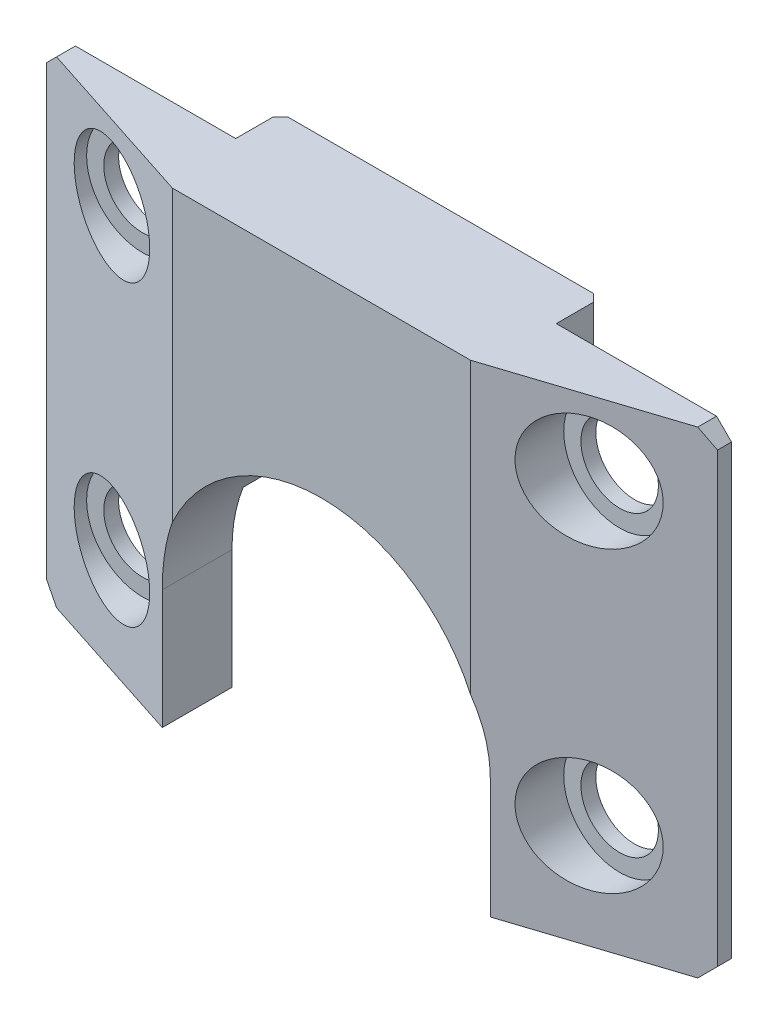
ISO-10303-21;
HEADER;
FILE_DESCRIPTION(('STEP AP214'),'2;1');
FILE_NAME('part.step','',(''),(''),'','','');
FILE_SCHEMA(('AUTOMOTIVE_DESIGN { 1 0 10303 214 1 1 1 1 }'));
ENDSEC;
DATA;
#1=APPLICATION_CONTEXT('core data for automotive mechanical design processes');
#2=APPLICATION_PROTOCOL_DEFINITION('international standard','automotive_design',2000,#1);
#3=PRODUCT_CONTEXT('',#1,'mechanical');
#4=PRODUCT('Part','Part','',(#3));
#5=PRODUCT_RELATED_PRODUCT_CATEGORY('part','',(#4));
#6=PRODUCT_DEFINITION_FORMATION('','',#4);
#7=PRODUCT_DEFINITION_CONTEXT('part definition',#1,'design');
#8=PRODUCT_DEFINITION('design','',#6,#7);
#9=PRODUCT_DEFINITION_SHAPE('','',#8);
#10=(LENGTH_UNIT() NAMED_UNIT(*) SI_UNIT(.MILLI.,.METRE.));
#11=(NAMED_UNIT(*) PLANE_ANGLE_UNIT() SI_UNIT($,.RADIAN.));
#12=(NAMED_UNIT(*) SI_UNIT($,.STERADIAN.) SOLID_ANGLE_UNIT());
#13=UNCERTAINTY_MEASURE_WITH_UNIT(LENGTH_MEASURE(1.E-05),#10,'distance_accuracy_value','');
#14=(GEOMETRIC_REPRESENTATION_CONTEXT(3) GLOBAL_UNCERTAINTY_ASSIGNED_CONTEXT((#13)) GLOBAL_UNIT_ASSIGNED_CONTEXT((#10,
#11,#12)) REPRESENTATION_CONTEXT('',''));
#15=CARTESIAN_POINT('',(0.,0.,0.));
#16=DIRECTION('',(0.,0.,1.));
#17=DIRECTION('',(1.,0.,0.));
#18=AXIS2_PLACEMENT_3D('',#15,#16,#17);
#19=CARTESIAN_POINT('',(0.,0.,-4.));
#20=DIRECTION('',(0.,0.,-1.));
#21=DIRECTION('',(-1.,0.,0.));
#22=AXIS2_PLACEMENT_3D('',#19,#20,#21);
#23=PLANE('',#22);
#24=CARTESIAN_POINT('',(-16.,-5.,-4.));
#25=DIRECTION('',(0.,0.,1.));
#26=DIRECTION('',(1.,0.,0.));
#27=AXIS2_PLACEMENT_3D('',#24,#25,#26);
#28=CIRCLE('',#27,2.6);
#29=CARTESIAN_POINT('',(-13.4,-5.,-4.));
#30=VERTEX_POINT('',#29);
#31=EDGE_CURVE('E175',#30,#30,#28,.F.);
#32=ORIENTED_EDGE('',*,*,#31,.T.);
#33=EDGE_LOOP('',(#32));
#34=FACE_BOUND('',#33,.T.);
#35=CARTESIAN_POINT('',(-16.,-5.,-4.));
#36=DIRECTION('',(0.,0.,-1.));
#37=DIRECTION('',(-1.,0.,0.));
#38=AXIS2_PLACEMENT_3D('',#35,#36,#37);
#39=CIRCLE('',#38,3.75);
#40=CARTESIAN_POINT('',(-19.75,-5.,-4.));
#41=VERTEX_POINT('',#40);
#42=EDGE_CURVE('E310',#41,#41,#39,.F.);
#43=ORIENTED_EDGE('',*,*,#42,.T.);
#44=EDGE_LOOP('',(#43));
#45=FACE_BOUND('',#44,.T.);
#46=ADVANCED_FACE('F16',(#34,#45),#23,.F.);
#47=CARTESIAN_POINT('',(0.,0.,-4.));
#48=DIRECTION('',(0.,0.,-1.));
#49=DIRECTION('',(-1.,0.,0.));
#50=AXIS2_PLACEMENT_3D('',#47,#48,#49);
#51=PLANE('',#50);
#52=CARTESIAN_POINT('',(-16.,-25.,-4.));
#53=DIRECTION('',(0.,0.,1.));
#54=DIRECTION('',(1.,0.,0.));
#55=AXIS2_PLACEMENT_3D('',#52,#53,#54);
#56=CIRCLE('',#55,2.6);
#57=CARTESIAN_POINT('',(-13.4,-25.,-4.));
#58=VERTEX_POINT('',#57);
#59=EDGE_CURVE('E213',#58,#58,#56,.F.);
#60=ORIENTED_EDGE('',*,*,#59,.T.);
#61=EDGE_LOOP('',(#60));
#62=FACE_BOUND('',#61,.T.);
#63=CARTESIAN_POINT('',(-16.,-25.,-4.));
#64=DIRECTION('',(0.,0.,-1.));
#65=DIRECTION('',(-1.,0.,0.));
#66=AXIS2_PLACEMENT_3D('',#63,#64,#65);
#67=CIRCLE('',#66,3.75);
#68=CARTESIAN_POINT('',(-19.75,-25.,-4.));
#69=VERTEX_POINT('',#68);
#70=EDGE_CURVE('E306',#69,#69,#67,.F.);
#71=ORIENTED_EDGE('',*,*,#70,.T.);
#72=EDGE_LOOP('',(#71));
#73=FACE_BOUND('',#72,.T.);
#74=ADVANCED_FACE('F333',(#62,#73),#51,.F.);
#75=CARTESIAN_POINT('',(-10.25,0.,-8.));
#76=DIRECTION('',(-0.707106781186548,0.,-0.707106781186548));
#77=DIRECTION('',(-0.707106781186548,0.,0.707106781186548));
#78=AXIS2_PLACEMENT_3D('',#75,#76,#77);
#79=PLANE('',#78);
#80=DIRECTION('',(-0.707106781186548,0.,0.707106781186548));
#81=VECTOR('',#80,1.);
#82=CARTESIAN_POINT('',(-10.25,0.,-8.));
#83=LINE('',#82,#81);
#84=CARTESIAN_POINT('',(-10.75,0.,-7.5));
#85=VERTEX_POINT('',#84);
#86=CARTESIAN_POINT('',(-10.25,0.,-8.));
#87=VERTEX_POINT('',#86);
#88=EDGE_CURVE('E163',#85,#87,#83,.F.);
#89=ORIENTED_EDGE('',*,*,#88,.T.);
#90=DIRECTION('',(0.,1.,0.));
#91=VECTOR('',#90,1.);
#92=CARTESIAN_POINT('',(-10.25,0.,-8.));
#93=LINE('',#92,#91);
#94=CARTESIAN_POINT('',(-10.2492760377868,-20.0027635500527,-8.00019195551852));
#95=VERTEX_POINT('',#94);
#96=EDGE_CURVE('E290',#95,#87,#93,.T.);
#97=ORIENTED_EDGE('',*,*,#96,.F.);
#98=DIRECTION('',(-0.707106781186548,0.,0.707106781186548));
#99=VECTOR('',#98,1.);
#100=CARTESIAN_POINT('',(8.375,-20.,-26.625));
#101=LINE('',#100,#99);
#102=CARTESIAN_POINT('',(-10.75,-20.,-7.5));
#103=VERTEX_POINT('',#102);
#104=EDGE_CURVE('E176',#95,#103,#101,.T.);
#105=ORIENTED_EDGE('',*,*,#104,.T.);
#106=DIRECTION('',(0.,1.,0.));
#107=VECTOR('',#106,1.);
#108=CARTESIAN_POINT('',(-10.75,0.,-7.5));
#109=LINE('',#108,#107);
#110=EDGE_CURVE('E180',#85,#103,#109,.F.);
#111=ORIENTED_EDGE('',*,*,#110,.F.);
#112=EDGE_LOOP('',(#89,#97,#105,#111));
#113=FACE_BOUND('',#112,.T.);
#114=ADVANCED_FACE('F181',(#113),#79,.T.);
#115=CARTESIAN_POINT('',(-16.,-5.,0.));
#116=DIRECTION('',(0.,0.,1.));
#117=DIRECTION('',(1.,0.,0.));
#118=AXIS2_PLACEMENT_3D('',#115,#116,#117);
#119=CYLINDRICAL_SURFACE('',#118,2.6);
#120=CARTESIAN_POINT('',(-16.,-5.,-5.));
#121=DIRECTION('',(0.,0.,1.));
#122=DIRECTION('',(1.,0.,0.));
#123=AXIS2_PLACEMENT_3D('',#120,#121,#122);
#124=CIRCLE('',#123,2.6);
#125=CARTESIAN_POINT('',(-13.4,-5.,-5.));
#126=VERTEX_POINT('',#125);
#127=EDGE_CURVE('E282',#126,#126,#124,.T.);
#128=ORIENTED_EDGE('',*,*,#127,.F.);
#129=EDGE_LOOP('',(#128));
#130=FACE_BOUND('',#129,.T.);
#131=ORIENTED_EDGE('',*,*,#31,.F.);
#132=EDGE_LOOP('',(#131));
#133=FACE_BOUND('',#132,.T.);
#134=ADVANCED_FACE('F320',(#130,#133),#119,.F.);
#135=CARTESIAN_POINT('',(-16.,-25.,0.));
#136=DIRECTION('',(0.,0.,1.));
#137=DIRECTION('',(1.,0.,0.));
#138=AXIS2_PLACEMENT_3D('',#135,#136,#137);
#139=CYLINDRICAL_SURFACE('',#138,2.6);
#140=CARTESIAN_POINT('',(-16.,-25.,-5.));
#141=DIRECTION('',(0.,0.,1.));
#142=DIRECTION('',(1.,0.,0.));
#143=AXIS2_PLACEMENT_3D('',#140,#141,#142);
#144=CIRCLE('',#143,2.6);
#145=CARTESIAN_POINT('',(-13.4,-25.,-5.));
#146=VERTEX_POINT('',#145);
#147=EDGE_CURVE('E278',#146,#146,#144,.T.);
#148=ORIENTED_EDGE('',*,*,#147,.F.);
#149=EDGE_LOOP('',(#148));
#150=FACE_BOUND('',#149,.T.);
#151=ORIENTED_EDGE('',*,*,#59,.F.);
#152=EDGE_LOOP('',(#151));
#153=FACE_BOUND('',#152,.T.);
#154=ADVANCED_FACE('F322',(#150,#153),#139,.F.);
#155=CARTESIAN_POINT('',(0.,-32.,0.));
#156=DIRECTION('',(0.,-1.,0.));
#157=DIRECTION('',(0.,0.,-1.));
#158=AXIS2_PLACEMENT_3D('',#155,#156,#157);
#159=PLANE('',#158);
#160=DIRECTION('',(0.,0.,1.));
#161=VECTOR('',#160,1.);
#162=CARTESIAN_POINT('',(-11.,-32.,0.));
#163=LINE('',#162,#161);
#164=CARTESIAN_POINT('',(-11.,-32.,-5.));
#165=VERTEX_POINT('',#164);
#166=CARTESIAN_POINT('',(-11.,-32.,-0.324919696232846));
#167=VERTEX_POINT('',#166);
#168=EDGE_CURVE('E458',#165,#167,#163,.T.);
#169=ORIENTED_EDGE('',*,*,#168,.T.);
#170=DIRECTION('',(-0.951056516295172,0.,-0.309016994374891));
#171=VECTOR('',#170,1.);
#172=CARTESIAN_POINT('',(-10.,-32.,0.));
#173=LINE('',#172,#171);
#174=CARTESIAN_POINT('',(-21.5,-32.,-3.73657650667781));
#175=VERTEX_POINT('',#174);
#176=EDGE_CURVE('E222',#167,#175,#173,.T.);
#177=ORIENTED_EDGE('',*,*,#176,.T.);
#178=DIRECTION('',(0.,0.,1.));
#179=VECTOR('',#178,1.);
#180=CARTESIAN_POINT('',(-21.5,-32.,0.));
#181=LINE('',#180,#179);
#182=CARTESIAN_POINT('',(-21.5,-32.,-5.));
#183=VERTEX_POINT('',#182);
#184=EDGE_CURVE('E210',#175,#183,#181,.F.);
#185=ORIENTED_EDGE('',*,*,#184,.T.);
#186=DIRECTION('',(-1.,0.,0.));
#187=VECTOR('',#186,1.);
#188=CARTESIAN_POINT('',(10.75,-32.,-5.));
#189=LINE('',#188,#187);
#190=EDGE_CURVE('E207',#165,#183,#189,.T.);
#191=ORIENTED_EDGE('',*,*,#190,.F.);
#192=EDGE_LOOP('',(#169,#177,#185,#191));
#193=FACE_BOUND('',#192,.T.);
#194=ADVANCED_FACE('F330',(#193),#159,.T.);
#195=CARTESIAN_POINT('',(-21.5,-32.,0.));
#196=DIRECTION('',(0.707106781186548,0.707106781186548,0.));
#197=DIRECTION('',(-0.707106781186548,0.707106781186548,0.));
#198=AXIS2_PLACEMENT_3D('',#195,#196,#197);
#199=PLANE('',#198);
#200=DIRECTION('',(-0.707106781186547,0.707106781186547,0.));
#201=VECTOR('',#200,1.);
#202=CARTESIAN_POINT('',(-21.5,-32.,-5.));
#203=LINE('',#202,#201);
#204=CARTESIAN_POINT('',(-22.5,-31.,-5.));
#205=VERTEX_POINT('',#204);
#206=EDGE_CURVE('E203',#183,#205,#203,.T.);
#207=ORIENTED_EDGE('',*,*,#206,.F.);
#208=ORIENTED_EDGE('',*,*,#184,.F.);
#209=DIRECTION('',(-0.689151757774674,0.689151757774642,-0.223918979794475));
#210=VECTOR('',#209,1.);
#211=CARTESIAN_POINT('',(-21.5000000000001,-32.,-3.7365765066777));
#212=LINE('',#211,#210);
#213=CARTESIAN_POINT('',(-22.5,-31.,-4.06149620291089));
#214=VERTEX_POINT('',#213);
#215=EDGE_CURVE('E220',#175,#214,#212,.T.);
#216=ORIENTED_EDGE('',*,*,#215,.T.);
#217=DIRECTION('',(0.,0.,1.));
#218=VECTOR('',#217,1.);
#219=CARTESIAN_POINT('',(-22.5,-31.,0.));
#220=LINE('',#219,#218);
#221=EDGE_CURVE('E212',#205,#214,#220,.T.);
#222=ORIENTED_EDGE('',*,*,#221,.F.);
#223=EDGE_LOOP('',(#207,#208,#216,#222));
#224=FACE_BOUND('',#223,.T.);
#225=ADVANCED_FACE('F449',(#224),#199,.F.);
#226=CARTESIAN_POINT('',(-22.5,0.,0.));
#227=DIRECTION('',(-1.,0.,0.));
#228=DIRECTION('',(0.,0.,1.));
#229=AXIS2_PLACEMENT_3D('',#226,#227,#228);
#230=PLANE('',#229);
#231=ORIENTED_EDGE('',*,*,#221,.T.);
#232=DIRECTION('',(0.,1.,0.));
#233=VECTOR('',#232,1.);
#234=CARTESIAN_POINT('',(-22.5000000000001,0.,-4.06149620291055));
#235=LINE('',#234,#233);
#236=CARTESIAN_POINT('',(-22.5,-1.,-4.06149620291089));
#237=VERTEX_POINT('',#236);
#238=EDGE_CURVE('E94',#214,#237,#235,.T.);
#239=ORIENTED_EDGE('',*,*,#238,.T.);
#240=DIRECTION('',(0.,0.,1.));
#241=VECTOR('',#240,1.);
#242=CARTESIAN_POINT('',(-22.5,-0.999999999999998,0.));
#243=LINE('',#242,#241);
#244=CARTESIAN_POINT('',(-22.5,-1.,-5.));
#245=VERTEX_POINT('',#244);
#246=EDGE_CURVE('E186',#245,#237,#243,.T.);
#247=ORIENTED_EDGE('',*,*,#246,.F.);
#248=DIRECTION('',(0.,1.,0.));
#249=VECTOR('',#248,1.);
#250=CARTESIAN_POINT('',(-22.5,0.,-5.));
#251=LINE('',#250,#249);
#252=EDGE_CURVE('E206',#205,#245,#251,.T.);
#253=ORIENTED_EDGE('',*,*,#252,.F.);
#254=EDGE_LOOP('',(#231,#239,#247,#253));
#255=FACE_BOUND('',#254,.T.);
#256=ADVANCED_FACE('F445',(#255),#230,.T.);
#257=CARTESIAN_POINT('',(-16.,-5.,-4.));
#258=DIRECTION('',(0.,0.,-1.));
#259=DIRECTION('',(-1.,0.,0.));
#260=AXIS2_PLACEMENT_3D('',#257,#258,#259);
#261=CYLINDRICAL_SURFACE('',#260,3.75);
#262=ORIENTED_EDGE('',*,*,#42,.F.);
#263=EDGE_LOOP('',(#262));
#264=FACE_BOUND('',#263,.T.);
#265=CARTESIAN_POINT('',(-16.,-5.,-1.94951817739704));
#266=DIRECTION('',(0.309016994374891,0.,-0.951056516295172));
#267=DIRECTION('',(-0.951056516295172,0.,-0.309016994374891));
#268=AXIS2_PLACEMENT_3D('',#265,#266,#267);
#269=ELLIPSE('',#268,3.94298334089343,3.75);
#270=CARTESIAN_POINT('',(-19.75,-5.,-3.1679670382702));
#271=VERTEX_POINT('',#270);
#272=EDGE_CURVE('E274',#271,#271,#269,.F.);
#273=ORIENTED_EDGE('',*,*,#272,.T.);
#274=EDGE_LOOP('',(#273));
#275=FACE_BOUND('',#274,.T.);
#276=ADVANCED_FACE('F441',(#264,#275),#261,.F.);
#277=CARTESIAN_POINT('',(-16.,-25.,-4.));
#278=DIRECTION('',(0.,0.,-1.));
#279=DIRECTION('',(-1.,0.,0.));
#280=AXIS2_PLACEMENT_3D('',#277,#278,#279);
#281=CYLINDRICAL_SURFACE('',#280,3.75);
#282=ORIENTED_EDGE('',*,*,#70,.F.);
#283=EDGE_LOOP('',(#282));
#284=FACE_BOUND('',#283,.T.);
#285=CARTESIAN_POINT('',(-16.,-25.,-1.94951817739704));
#286=DIRECTION('',(0.309016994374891,0.,-0.951056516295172));
#287=DIRECTION('',(-0.951056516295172,0.,-0.309016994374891));
#288=AXIS2_PLACEMENT_3D('',#285,#286,#287);
#289=ELLIPSE('',#288,3.94298334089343,3.75);
#290=CARTESIAN_POINT('',(-19.75,-25.,-3.1679670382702));
#291=VERTEX_POINT('',#290);
#292=EDGE_CURVE('E270',#291,#291,#289,.F.);
#293=ORIENTED_EDGE('',*,*,#292,.T.);
#294=EDGE_LOOP('',(#293));
#295=FACE_BOUND('',#294,.T.);
#296=ADVANCED_FACE('F437',(#284,#295),#281,.F.);
#297=CARTESIAN_POINT('',(16.,-5.,-4.));
#298=DIRECTION('',(0.,0.,-1.));
#299=DIRECTION('',(-1.,0.,0.));
#300=AXIS2_PLACEMENT_3D('',#297,#298,#299);
#301=CYLINDRICAL_SURFACE('',#300,3.75);
#302=CARTESIAN_POINT('',(16.,-5.,-4.));
#303=DIRECTION('',(0.,0.,-1.));
#304=DIRECTION('',(-1.,0.,0.));
#305=AXIS2_PLACEMENT_3D('',#302,#303,#304);
#306=CIRCLE('',#305,3.75);
#307=CARTESIAN_POINT('',(12.25,-5.,-4.));
#308=VERTEX_POINT('',#307);
#309=EDGE_CURVE('E266',#308,#308,#306,.T.);
#310=ORIENTED_EDGE('',*,*,#309,.T.);
#311=EDGE_LOOP('',(#310));
#312=FACE_BOUND('',#311,.T.);
#313=CARTESIAN_POINT('',(16.,-5.,-1.94951817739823));
#314=DIRECTION('',(-0.309016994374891,0.,-0.951056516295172));
#315=DIRECTION('',(0.951056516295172,0.,-0.309016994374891));
#316=AXIS2_PLACEMENT_3D('',#313,#314,#315);
#317=ELLIPSE('',#316,3.94298334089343,3.75);
#318=CARTESIAN_POINT('',(19.75,-5.,-3.16796703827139));
#319=VERTEX_POINT('',#318);
#320=EDGE_CURVE('E301',#319,#319,#317,.F.);
#321=ORIENTED_EDGE('',*,*,#320,.T.);
#322=EDGE_LOOP('',(#321));
#323=FACE_BOUND('',#322,.T.);
#324=ADVANCED_FACE('F433',(#312,#323),#301,.F.);
#325=CARTESIAN_POINT('',(16.,-25.,-4.));
#326=DIRECTION('',(0.,0.,-1.));
#327=DIRECTION('',(-1.,0.,0.));
#328=AXIS2_PLACEMENT_3D('',#325,#326,#327);
#329=CYLINDRICAL_SURFACE('',#328,3.75);
#330=CARTESIAN_POINT('',(16.,-25.,-4.));
#331=DIRECTION('',(0.,0.,-1.));
#332=DIRECTION('',(-1.,0.,0.));
#333=AXIS2_PLACEMENT_3D('',#330,#331,#332);
#334=CIRCLE('',#333,3.75);
#335=CARTESIAN_POINT('',(12.25,-25.,-4.));
#336=VERTEX_POINT('',#335);
#337=EDGE_CURVE('E263',#336,#336,#334,.T.);
#338=ORIENTED_EDGE('',*,*,#337,.T.);
#339=EDGE_LOOP('',(#338));
#340=FACE_BOUND('',#339,.T.);
#341=CARTESIAN_POINT('',(16.,-25.,-1.94951817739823));
#342=DIRECTION('',(-0.309016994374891,0.,-0.951056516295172));
#343=DIRECTION('',(0.951056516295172,0.,-0.309016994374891));
#344=AXIS2_PLACEMENT_3D('',#341,#342,#343);
#345=ELLIPSE('',#344,3.94298334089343,3.75);
#346=CARTESIAN_POINT('',(19.75,-25.,-3.16796703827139));
#347=VERTEX_POINT('',#346);
#348=EDGE_CURVE('E185',#347,#347,#345,.F.);
#349=ORIENTED_EDGE('',*,*,#348,.T.);
#350=EDGE_LOOP('',(#349));
#351=FACE_BOUND('',#350,.T.);
#352=ADVANCED_FACE('F430',(#340,#351),#329,.F.);
#353=CARTESIAN_POINT('',(10.75,0.,-7.5));
#354=DIRECTION('',(0.707106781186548,0.,-0.707106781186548));
#355=DIRECTION('',(-0.707106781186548,0.,-0.707106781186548));
#356=AXIS2_PLACEMENT_3D('',#353,#354,#355);
#357=PLANE('',#356);
#358=DIRECTION('',(-0.707106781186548,0.,-0.707106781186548));
#359=VECTOR('',#358,1.);
#360=CARTESIAN_POINT('',(10.75,0.,-7.5));
#361=LINE('',#360,#359);
#362=CARTESIAN_POINT('',(10.25,0.,-8.));
#363=VERTEX_POINT('',#362);
#364=CARTESIAN_POINT('',(10.75,0.,-7.5));
#365=VERTEX_POINT('',#364);
#366=EDGE_CURVE('E309',#363,#365,#361,.F.);
#367=ORIENTED_EDGE('',*,*,#366,.T.);
#368=DIRECTION('',(0.,1.,0.));
#369=VECTOR('',#368,1.);
#370=CARTESIAN_POINT('',(10.75,0.,-7.5));
#371=LINE('',#370,#369);
#372=CARTESIAN_POINT('',(10.75,-20.,-7.5));
#373=VERTEX_POINT('',#372);
#374=EDGE_CURVE('E82',#373,#365,#371,.T.);
#375=ORIENTED_EDGE('',*,*,#374,.F.);
#376=DIRECTION('',(-0.707106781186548,0.,-0.707106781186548));
#377=VECTOR('',#376,1.);
#378=CARTESIAN_POINT('',(10.75,-20.,-7.5));
#379=LINE('',#378,#377);
#380=CARTESIAN_POINT('',(10.2492074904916,-20.0027399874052,-8.00012340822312));
#381=VERTEX_POINT('',#380);
#382=EDGE_CURVE('E294',#373,#381,#379,.T.);
#383=ORIENTED_EDGE('',*,*,#382,.T.);
#384=DIRECTION('',(0.,-1.,0.));
#385=VECTOR('',#384,1.);
#386=CARTESIAN_POINT('',(10.25,0.,-8.));
#387=LINE('',#386,#385);
#388=EDGE_CURVE('E286',#363,#381,#387,.T.);
#389=ORIENTED_EDGE('',*,*,#388,.F.);
#390=EDGE_LOOP('',(#367,#375,#383,#389));
#391=FACE_BOUND('',#390,.T.);
#392=ADVANCED_FACE('F426',(#391),#357,.T.);
#393=CARTESIAN_POINT('',(-21.5,0.,0.));
#394=DIRECTION('',(-0.707106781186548,0.707106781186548,0.));
#395=DIRECTION('',(-0.707106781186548,-0.707106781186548,0.));
#396=AXIS2_PLACEMENT_3D('',#393,#394,#395);
#397=PLANE('',#396);
#398=ORIENTED_EDGE('',*,*,#246,.T.);
#399=DIRECTION('',(0.689151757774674,0.689151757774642,0.223918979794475));
#400=VECTOR('',#399,1.);
#401=CARTESIAN_POINT('',(-22.5000000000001,-1.,-4.06149620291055));
#402=LINE('',#401,#400);
#403=CARTESIAN_POINT('',(-21.5,0.,-3.73657650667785));
#404=VERTEX_POINT('',#403);
#405=EDGE_CURVE('E277',#237,#404,#402,.T.);
#406=ORIENTED_EDGE('',*,*,#405,.T.);
#407=DIRECTION('',(0.,0.,-1.));
#408=VECTOR('',#407,1.);
#409=CARTESIAN_POINT('',(-21.5,0.,0.));
#410=LINE('',#409,#408);
#411=CARTESIAN_POINT('',(-21.5,0.,-5.));
#412=VERTEX_POINT('',#411);
#413=EDGE_CURVE('E196',#404,#412,#410,.T.);
#414=ORIENTED_EDGE('',*,*,#413,.T.);
#415=DIRECTION('',(0.707106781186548,0.707106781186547,0.));
#416=VECTOR('',#415,1.);
#417=CARTESIAN_POINT('',(-22.5,-1.,-5.));
#418=LINE('',#417,#416);
#419=EDGE_CURVE('E487',#245,#412,#418,.T.);
#420=ORIENTED_EDGE('',*,*,#419,.F.);
#421=EDGE_LOOP('',(#398,#406,#414,#420));
#422=FACE_BOUND('',#421,.T.);
#423=ADVANCED_FACE('F423',(#422),#397,.T.);
#424=CARTESIAN_POINT('',(-10.75,0.,-5.));
#425=DIRECTION('',(-1.,0.,0.));
#426=DIRECTION('',(0.,0.,1.));
#427=AXIS2_PLACEMENT_3D('',#424,#425,#426);
#428=PLANE('',#427);
#429=ORIENTED_EDGE('',*,*,#110,.T.);
#430=DIRECTION('',(0.,0.,1.));
#431=VECTOR('',#430,1.);
#432=CARTESIAN_POINT('',(-10.75,-20.,-8.));
#433=LINE('',#432,#431);
#434=CARTESIAN_POINT('',(-10.75,-20.,-5.));
#435=VERTEX_POINT('',#434);
#436=EDGE_CURVE('E289',#103,#435,#433,.T.);
#437=ORIENTED_EDGE('',*,*,#436,.T.);
#438=DIRECTION('',(0.,1.,0.));
#439=VECTOR('',#438,1.);
#440=CARTESIAN_POINT('',(-10.75,0.,-5.));
#441=LINE('',#440,#439);
#442=CARTESIAN_POINT('',(-10.75,0.,-5.));
#443=VERTEX_POINT('',#442);
#444=EDGE_CURVE('E190',#443,#435,#441,.F.);
#445=ORIENTED_EDGE('',*,*,#444,.F.);
#446=DIRECTION('',(0.,0.,-1.));
#447=VECTOR('',#446,1.);
#448=CARTESIAN_POINT('',(-10.75,0.,0.));
#449=LINE('',#448,#447);
#450=EDGE_CURVE('E169',#443,#85,#449,.T.);
#451=ORIENTED_EDGE('',*,*,#450,.T.);
#452=EDGE_LOOP('',(#429,#437,#445,#451));
#453=FACE_BOUND('',#452,.T.);
#454=ADVANCED_FACE('F188',(#453),#428,.T.);
#455=CARTESIAN_POINT('',(30.,0.,-6.498393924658));
#456=DIRECTION('',(-0.309016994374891,0.,-0.951056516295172));
#457=DIRECTION('',(-0.951056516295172,0.,0.309016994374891));
#458=AXIS2_PLACEMENT_3D('',#455,#456,#457);
#459=PLANE('',#458);
#460=ORIENTED_EDGE('',*,*,#320,.F.);
#461=EDGE_LOOP('',(#460));
#462=FACE_BOUND('',#461,.T.);
#463=ORIENTED_EDGE('',*,*,#348,.F.);
#464=EDGE_LOOP('',(#463));
#465=FACE_BOUND('',#464,.T.);
#466=DIRECTION('',(0.,1.,0.));
#467=VECTOR('',#466,1.);
#468=CARTESIAN_POINT('',(10.,0.,0.));
#469=LINE('',#468,#467);
#470=CARTESIAN_POINT('',(9.99999999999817,-19.4174243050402,0.));
#471=VERTEX_POINT('',#470);
#472=CARTESIAN_POINT('',(9.99999999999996,0.,0.));
#473=VERTEX_POINT('',#472);
#474=EDGE_CURVE('E269',#471,#473,#469,.T.);
#475=ORIENTED_EDGE('',*,*,#474,.F.);
#476=CARTESIAN_POINT('',(0.,-24.,3.24919696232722));
#477=DIRECTION('',(-0.309016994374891,0.,-0.951056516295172));
#478=DIRECTION('',(-0.951056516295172,0.,0.309016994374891));
#479=AXIS2_PLACEMENT_3D('',#476,#477,#478);
#480=ELLIPSE('',#479,11.5660844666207,11.);
#481=CARTESIAN_POINT('',(11.,-24.,-0.324919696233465));
#482=VERTEX_POINT('',#481);
#483=EDGE_CURVE('E260',#471,#482,#480,.T.);
#484=ORIENTED_EDGE('',*,*,#483,.T.);
#485=DIRECTION('',(0.,1.,0.));
#486=VECTOR('',#485,1.);
#487=CARTESIAN_POINT('',(11.,-32.,-0.3249196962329));
#488=LINE('',#487,#486);
#489=CARTESIAN_POINT('',(11.,-32.,-0.3249196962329));
#490=VERTEX_POINT('',#489);
#491=EDGE_CURVE('E503',#482,#490,#488,.F.);
#492=ORIENTED_EDGE('',*,*,#491,.T.);
#493=DIRECTION('',(-0.951056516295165,0.,0.309016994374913));
#494=VECTOR('',#493,1.);
#495=CARTESIAN_POINT('',(21.5,-32.,-3.736576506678));
#496=LINE('',#495,#494);
#497=CARTESIAN_POINT('',(21.5,-32.,-3.736576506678));
#498=VERTEX_POINT('',#497);
#499=EDGE_CURVE('E505',#498,#490,#496,.T.);
#500=ORIENTED_EDGE('',*,*,#499,.F.);
#501=DIRECTION('',(0.689151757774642,0.689151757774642,-0.223918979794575));
#502=VECTOR('',#501,1.);
#503=CARTESIAN_POINT('',(21.5,-32.,-3.736576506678));
#504=LINE('',#503,#502);
#505=CARTESIAN_POINT('',(22.5,-31.,-4.061496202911));
#506=VERTEX_POINT('',#505);
#507=EDGE_CURVE('E513',#498,#506,#504,.T.);
#508=ORIENTED_EDGE('',*,*,#507,.T.);
#509=DIRECTION('',(0.,1.,0.));
#510=VECTOR('',#509,1.);
#511=CARTESIAN_POINT('',(22.5,0.,-4.061496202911));
#512=LINE('',#511,#510);
#513=CARTESIAN_POINT('',(22.5,-0.999999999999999,-4.061496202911));
#514=VERTEX_POINT('',#513);
#515=EDGE_CURVE('E516',#514,#506,#512,.F.);
#516=ORIENTED_EDGE('',*,*,#515,.F.);
#517=DIRECTION('',(0.689151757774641,-0.689151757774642,-0.223918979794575));
#518=VECTOR('',#517,1.);
#519=CARTESIAN_POINT('',(21.5,0.,-3.736576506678));
#520=LINE('',#519,#518);
#521=CARTESIAN_POINT('',(21.5,0.,-3.736576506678));
#522=VERTEX_POINT('',#521);
#523=EDGE_CURVE('E524',#522,#514,#520,.T.);
#524=ORIENTED_EDGE('',*,*,#523,.F.);
#525=DIRECTION('',(-0.951056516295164,0.,0.309016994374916));
#526=VECTOR('',#525,1.);
#527=CARTESIAN_POINT('',(21.5,0.,-3.736576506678));
#528=LINE('',#527,#526);
#529=EDGE_CURVE('E529',#522,#473,#528,.T.);
#530=ORIENTED_EDGE('',*,*,#529,.T.);
#531=EDGE_LOOP('',(#475,#484,#492,#500,#508,#516,#524,#530));
#532=FACE_BOUND('',#531,.T.);
#533=ADVANCED_FACE('F416',(#462,#465,#532),#459,.F.);
#534=CARTESIAN_POINT('',(27.,-20.,-8.));
#535=DIRECTION('',(0.,1.,0.));
#536=DIRECTION('',(0.,0.,1.));
#537=AXIS2_PLACEMENT_3D('',#534,#535,#536);
#538=PLANE('',#537);
#539=DIRECTION('',(0.,0.,-1.));
#540=VECTOR('',#539,1.);
#541=CARTESIAN_POINT('',(10.75,-20.,-8.));
#542=LINE('',#541,#540);
#543=CARTESIAN_POINT('',(10.75,-20.,-5.));
#544=VERTEX_POINT('',#543);
#545=EDGE_CURVE('E532',#544,#373,#542,.T.);
#546=ORIENTED_EDGE('',*,*,#545,.F.);
#547=DIRECTION('',(1.,0.,0.));
#548=VECTOR('',#547,1.);
#549=CARTESIAN_POINT('',(27.,-20.,-5.));
#550=LINE('',#549,#548);
#551=CARTESIAN_POINT('',(10.2469507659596,-20.,-5.));
#552=VERTEX_POINT('',#551);
#553=EDGE_CURVE('E298',#552,#544,#550,.T.);
#554=ORIENTED_EDGE('',*,*,#553,.F.);
#555=DIRECTION('',(0.,0.,1.));
#556=VECTOR('',#555,1.);
#557=CARTESIAN_POINT('',(10.2469507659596,-20.,-5.));
#558=LINE('',#557,#556);
#559=EDGE_CURVE('E253',#552,#381,#558,.F.);
#560=ORIENTED_EDGE('',*,*,#559,.T.);
#561=ORIENTED_EDGE('',*,*,#382,.F.);
#562=EDGE_LOOP('',(#546,#554,#560,#561));
#563=FACE_BOUND('',#562,.T.);
#564=ADVANCED_FACE('F412',(#563),#538,.F.);
#565=CARTESIAN_POINT('',(-10.75,0.,-8.));
#566=DIRECTION('',(0.,0.,-1.));
#567=DIRECTION('',(-1.,0.,0.));
#568=AXIS2_PLACEMENT_3D('',#565,#566,#567);
#569=PLANE('',#568);
#570=ORIENTED_EDGE('',*,*,#388,.T.);
#571=CARTESIAN_POINT('',(0.,-24.,-8.));
#572=DIRECTION('',(0.,0.,1.));
#573=DIRECTION('',(1.,0.,0.));
#574=AXIS2_PLACEMENT_3D('',#571,#572,#573);
#575=CIRCLE('',#574,11.);
#576=EDGE_CURVE('E248',#381,#95,#575,.T.);
#577=ORIENTED_EDGE('',*,*,#576,.T.);
#578=ORIENTED_EDGE('',*,*,#96,.T.);
#579=DIRECTION('',(1.,0.,0.));
#580=VECTOR('',#579,1.);
#581=CARTESIAN_POINT('',(0.,0.,-8.));
#582=LINE('',#581,#580);
#583=EDGE_CURVE('E171',#87,#363,#582,.T.);
#584=ORIENTED_EDGE('',*,*,#583,.T.);
#585=EDGE_LOOP('',(#570,#577,#578,#584));
#586=FACE_BOUND('',#585,.T.);
#587=ADVANCED_FACE('F408',(#586),#569,.T.);
#588=CARTESIAN_POINT('',(27.,-20.,-8.));
#589=DIRECTION('',(0.,1.,0.));
#590=DIRECTION('',(0.,0.,1.));
#591=AXIS2_PLACEMENT_3D('',#588,#589,#590);
#592=PLANE('',#591);
#593=ORIENTED_EDGE('',*,*,#436,.F.);
#594=ORIENTED_EDGE('',*,*,#104,.F.);
#595=DIRECTION('',(0.,0.,1.));
#596=VECTOR('',#595,1.);
#597=CARTESIAN_POINT('',(-10.2469507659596,-20.,-8.00019195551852));
#598=LINE('',#597,#596);
#599=CARTESIAN_POINT('',(-10.2469507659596,-20.,-5.));
#600=VERTEX_POINT('',#599);
#601=EDGE_CURVE('E246',#95,#600,#598,.T.);
#602=ORIENTED_EDGE('',*,*,#601,.T.);
#603=DIRECTION('',(-1.,0.,0.));
#604=VECTOR('',#603,1.);
#605=CARTESIAN_POINT('',(10.75,-20.,-5.));
#606=LINE('',#605,#604);
#607=EDGE_CURVE('E285',#435,#600,#606,.F.);
#608=ORIENTED_EDGE('',*,*,#607,.F.);
#609=EDGE_LOOP('',(#593,#594,#602,#608));
#610=FACE_BOUND('',#609,.T.);
#611=ADVANCED_FACE('F404',(#610),#592,.F.);
#612=CARTESIAN_POINT('',(10.75,0.,-5.));
#613=DIRECTION('',(0.,0.,-1.));
#614=DIRECTION('',(-1.,0.,0.));
#615=AXIS2_PLACEMENT_3D('',#612,#613,#614);
#616=PLANE('',#615);
#617=ORIENTED_EDGE('',*,*,#147,.T.);
#618=EDGE_LOOP('',(#617));
#619=FACE_BOUND('',#618,.T.);
#620=ORIENTED_EDGE('',*,*,#127,.T.);
#621=EDGE_LOOP('',(#620));
#622=FACE_BOUND('',#621,.T.);
#623=ORIENTED_EDGE('',*,*,#607,.T.);
#624=CARTESIAN_POINT('',(0.,-24.,-5.));
#625=DIRECTION('',(0.,0.,1.));
#626=DIRECTION('',(1.,0.,0.));
#627=AXIS2_PLACEMENT_3D('',#624,#625,#626);
#628=CIRCLE('',#627,11.);
#629=CARTESIAN_POINT('',(-11.,-24.,-5.));
#630=VERTEX_POINT('',#629);
#631=EDGE_CURVE('E244',#600,#630,#628,.T.);
#632=ORIENTED_EDGE('',*,*,#631,.T.);
#633=DIRECTION('',(0.,1.,0.));
#634=VECTOR('',#633,1.);
#635=CARTESIAN_POINT('',(-11.,-24.,-5.));
#636=LINE('',#635,#634);
#637=EDGE_CURVE('E281',#630,#165,#636,.F.);
#638=ORIENTED_EDGE('',*,*,#637,.T.);
#639=ORIENTED_EDGE('',*,*,#190,.T.);
#640=ORIENTED_EDGE('',*,*,#206,.T.);
#641=ORIENTED_EDGE('',*,*,#252,.T.);
#642=ORIENTED_EDGE('',*,*,#419,.T.);
#643=DIRECTION('',(1.,0.,0.));
#644=VECTOR('',#643,1.);
#645=CARTESIAN_POINT('',(0.,0.,-5.));
#646=LINE('',#645,#644);
#647=EDGE_CURVE('E192',#412,#443,#646,.T.);
#648=ORIENTED_EDGE('',*,*,#647,.T.);
#649=ORIENTED_EDGE('',*,*,#444,.T.);
#650=EDGE_LOOP('',(#623,#632,#638,#639,#640,#641,#642,#648,#649));
#651=FACE_BOUND('',#650,.T.);
#652=ADVANCED_FACE('F400',(#619,#622,#651),#616,.T.);
#653=CARTESIAN_POINT('',(-11.,-24.,0.));
#654=DIRECTION('',(-1.,0.,0.));
#655=DIRECTION('',(0.,0.,1.));
#656=AXIS2_PLACEMENT_3D('',#653,#654,#655);
#657=PLANE('',#656);
#658=ORIENTED_EDGE('',*,*,#637,.F.);
#659=DIRECTION('',(0.,0.,1.));
#660=VECTOR('',#659,1.);
#661=CARTESIAN_POINT('',(-11.,-24.,0.));
#662=LINE('',#661,#660);
#663=CARTESIAN_POINT('',(-11.,-24.,-0.324919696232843));
#664=VERTEX_POINT('',#663);
#665=EDGE_CURVE('E243',#630,#664,#662,.T.);
#666=ORIENTED_EDGE('',*,*,#665,.T.);
#667=DIRECTION('',(0.,1.,0.));
#668=VECTOR('',#667,1.);
#669=CARTESIAN_POINT('',(-11.,0.,-0.324919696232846));
#670=LINE('',#669,#668);
#671=EDGE_CURVE('E465',#664,#167,#670,.F.);
#672=ORIENTED_EDGE('',*,*,#671,.T.);
#673=ORIENTED_EDGE('',*,*,#168,.F.);
#674=EDGE_LOOP('',(#658,#666,#672,#673));
#675=FACE_BOUND('',#674,.T.);
#676=ADVANCED_FACE('F396',(#675),#657,.F.);
#677=CARTESIAN_POINT('',(-10.,0.,0.));
#678=DIRECTION('',(0.309016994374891,0.,-0.951056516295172));
#679=DIRECTION('',(-0.951056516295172,0.,-0.309016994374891));
#680=AXIS2_PLACEMENT_3D('',#677,#678,#679);
#681=PLANE('',#680);
#682=ORIENTED_EDGE('',*,*,#292,.F.);
#683=EDGE_LOOP('',(#682));
#684=FACE_BOUND('',#683,.T.);
#685=ORIENTED_EDGE('',*,*,#272,.F.);
#686=EDGE_LOOP('',(#685));
#687=FACE_BOUND('',#686,.T.);
#688=DIRECTION('',(-0.951056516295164,0.,-0.309016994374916));
#689=VECTOR('',#688,1.);
#690=CARTESIAN_POINT('',(-10.,0.,0.));
#691=LINE('',#690,#689);
#692=CARTESIAN_POINT('',(-10.,0.,0.));
#693=VERTEX_POINT('',#692);
#694=EDGE_CURVE('E541',#693,#404,#691,.T.);
#695=ORIENTED_EDGE('',*,*,#694,.T.);
#696=ORIENTED_EDGE('',*,*,#405,.F.);
#697=ORIENTED_EDGE('',*,*,#238,.F.);
#698=ORIENTED_EDGE('',*,*,#215,.F.);
#699=ORIENTED_EDGE('',*,*,#176,.F.);
#700=ORIENTED_EDGE('',*,*,#671,.F.);
#701=CARTESIAN_POINT('',(0.,-24.,3.24919696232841));
#702=DIRECTION('',(0.309016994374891,0.,-0.951056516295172));
#703=DIRECTION('',(0.951056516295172,0.,0.309016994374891));
#704=AXIS2_PLACEMENT_3D('',#701,#702,#703);
#705=ELLIPSE('',#704,11.5660844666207,11.);
#706=CARTESIAN_POINT('',(-10.,-19.4174243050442,0.));
#707=VERTEX_POINT('',#706);
#708=EDGE_CURVE('E241',#664,#707,#705,.T.);
#709=ORIENTED_EDGE('',*,*,#708,.T.);
#710=DIRECTION('',(0.,1.,0.));
#711=VECTOR('',#710,1.);
#712=CARTESIAN_POINT('',(-10.,0.,0.));
#713=LINE('',#712,#711);
#714=EDGE_CURVE('E273',#693,#707,#713,.F.);
#715=ORIENTED_EDGE('',*,*,#714,.F.);
#716=EDGE_LOOP('',(#695,#696,#697,#698,#699,#700,#709,#715));
#717=FACE_BOUND('',#716,.T.);
#718=ADVANCED_FACE('F392',(#684,#687,#717),#681,.F.);
#719=CARTESIAN_POINT('',(22.5,0.,0.));
#720=DIRECTION('',(0.,0.,1.));
#721=DIRECTION('',(1.,0.,0.));
#722=AXIS2_PLACEMENT_3D('',#719,#720,#721);
#723=PLANE('',#722);
#724=CARTESIAN_POINT('',(0.,-24.,0.));
#725=DIRECTION('',(0.,0.,1.));
#726=DIRECTION('',(1.,0.,0.));
#727=AXIS2_PLACEMENT_3D('',#724,#725,#726);
#728=CIRCLE('',#727,11.);
#729=EDGE_CURVE('E238',#707,#471,#728,.F.);
#730=ORIENTED_EDGE('',*,*,#729,.T.);
#731=ORIENTED_EDGE('',*,*,#474,.T.);
#732=DIRECTION('',(1.,0.,0.));
#733=VECTOR('',#732,1.);
#734=CARTESIAN_POINT('',(0.,0.,0.));
#735=LINE('',#734,#733);
#736=EDGE_CURVE('E531',#473,#693,#735,.F.);
#737=ORIENTED_EDGE('',*,*,#736,.T.);
#738=ORIENTED_EDGE('',*,*,#714,.T.);
#739=EDGE_LOOP('',(#730,#731,#737,#738));
#740=FACE_BOUND('',#739,.T.);
#741=ADVANCED_FACE('F388',(#740),#723,.T.);
#742=CARTESIAN_POINT('',(0.,0.,-4.));
#743=DIRECTION('',(0.,0.,-1.));
#744=DIRECTION('',(-1.,0.,0.));
#745=AXIS2_PLACEMENT_3D('',#742,#743,#744);
#746=PLANE('',#745);
#747=CARTESIAN_POINT('',(16.,-5.,-4.));
#748=DIRECTION('',(0.,0.,1.));
#749=DIRECTION('',(1.,0.,0.));
#750=AXIS2_PLACEMENT_3D('',#747,#748,#749);
#751=CIRCLE('',#750,2.6);
#752=CARTESIAN_POINT('',(18.6,-5.,-4.));
#753=VERTEX_POINT('',#752);
#754=EDGE_CURVE('E235',#753,#753,#751,.F.);
#755=ORIENTED_EDGE('',*,*,#754,.T.);
#756=EDGE_LOOP('',(#755));
#757=FACE_BOUND('',#756,.T.);
#758=ORIENTED_EDGE('',*,*,#309,.F.);
#759=EDGE_LOOP('',(#758));
#760=FACE_BOUND('',#759,.T.);
#761=ADVANCED_FACE('F384',(#757,#760),#746,.F.);
#762=CARTESIAN_POINT('',(0.,0.,-4.));
#763=DIRECTION('',(0.,0.,-1.));
#764=DIRECTION('',(-1.,0.,0.));
#765=AXIS2_PLACEMENT_3D('',#762,#763,#764);
#766=PLANE('',#765);
#767=CARTESIAN_POINT('',(16.,-25.,-4.));
#768=DIRECTION('',(0.,0.,1.));
#769=DIRECTION('',(1.,0.,0.));
#770=AXIS2_PLACEMENT_3D('',#767,#768,#769);
#771=CIRCLE('',#770,2.6);
#772=CARTESIAN_POINT('',(18.6,-25.,-4.));
#773=VERTEX_POINT('',#772);
#774=EDGE_CURVE('E231',#773,#773,#771,.F.);
#775=ORIENTED_EDGE('',*,*,#774,.T.);
#776=EDGE_LOOP('',(#775));
#777=FACE_BOUND('',#776,.T.);
#778=ORIENTED_EDGE('',*,*,#337,.F.);
#779=EDGE_LOOP('',(#778));
#780=FACE_BOUND('',#779,.T.);
#781=ADVANCED_FACE('F380',(#777,#780),#766,.F.);
#782=CARTESIAN_POINT('',(10.75,0.,-8.));
#783=DIRECTION('',(1.,0.,0.));
#784=DIRECTION('',(0.,0.,-1.));
#785=AXIS2_PLACEMENT_3D('',#782,#783,#784);
#786=PLANE('',#785);
#787=DIRECTION('',(0.,1.,0.));
#788=VECTOR('',#787,1.);
#789=CARTESIAN_POINT('',(10.75,0.,-5.));
#790=LINE('',#789,#788);
#791=CARTESIAN_POINT('',(10.75,0.,-5.));
#792=VERTEX_POINT('',#791);
#793=EDGE_CURVE('E234',#544,#792,#790,.T.);
#794=ORIENTED_EDGE('',*,*,#793,.F.);
#795=ORIENTED_EDGE('',*,*,#545,.T.);
#796=ORIENTED_EDGE('',*,*,#374,.T.);
#797=DIRECTION('',(0.,0.,-1.));
#798=VECTOR('',#797,1.);
#799=CARTESIAN_POINT('',(10.75,0.,0.));
#800=LINE('',#799,#798);
#801=EDGE_CURVE('E194',#365,#792,#800,.F.);
#802=ORIENTED_EDGE('',*,*,#801,.T.);
#803=EDGE_LOOP('',(#794,#795,#796,#802));
#804=FACE_BOUND('',#803,.T.);
#805=ADVANCED_FACE('F377',(#804),#786,.T.);
#806=CARTESIAN_POINT('',(0.,0.,0.));
#807=DIRECTION('',(0.,-1.,0.));
#808=DIRECTION('',(0.,0.,-1.));
#809=AXIS2_PLACEMENT_3D('',#806,#807,#808);
#810=PLANE('',#809);
#811=DIRECTION('',(-1.,0.,0.));
#812=VECTOR('',#811,1.);
#813=CARTESIAN_POINT('',(10.75,0.,-5.));
#814=LINE('',#813,#812);
#815=CARTESIAN_POINT('',(21.5,0.,-5.));
#816=VERTEX_POINT('',#815);
#817=EDGE_CURVE('E603',#792,#816,#814,.F.);
#818=ORIENTED_EDGE('',*,*,#817,.F.);
#819=ORIENTED_EDGE('',*,*,#801,.F.);
#820=ORIENTED_EDGE('',*,*,#366,.F.);
#821=ORIENTED_EDGE('',*,*,#583,.F.);
#822=ORIENTED_EDGE('',*,*,#88,.F.);
#823=ORIENTED_EDGE('',*,*,#450,.F.);
#824=ORIENTED_EDGE('',*,*,#647,.F.);
#825=ORIENTED_EDGE('',*,*,#413,.F.);
#826=ORIENTED_EDGE('',*,*,#694,.F.);
#827=ORIENTED_EDGE('',*,*,#736,.F.);
#828=ORIENTED_EDGE('',*,*,#529,.F.);
#829=DIRECTION('',(0.,0.,1.));
#830=VECTOR('',#829,1.);
#831=CARTESIAN_POINT('',(21.5,0.,-5.));
#832=LINE('',#831,#830);
#833=EDGE_CURVE('E526',#816,#522,#832,.T.);
#834=ORIENTED_EDGE('',*,*,#833,.F.);
#835=EDGE_LOOP('',(#818,#819,#820,#821,#822,#823,#824,#825,#826,#827,#828,#834));
#836=FACE_BOUND('',#835,.T.);
#837=ADVANCED_FACE('F166',(#836),#810,.F.);
#838=CARTESIAN_POINT('',(21.5,0.,-5.));
#839=DIRECTION('',(0.707106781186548,0.707106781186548,0.));
#840=DIRECTION('',(-0.707106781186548,0.707106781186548,0.));
#841=AXIS2_PLACEMENT_3D('',#838,#839,#840);
#842=PLANE('',#841);
#843=ORIENTED_EDGE('',*,*,#833,.T.);
#844=ORIENTED_EDGE('',*,*,#523,.T.);
#845=DIRECTION('',(0.,0.,-1.));
#846=VECTOR('',#845,1.);
#847=CARTESIAN_POINT('',(22.5,-1.,-5.));
#848=LINE('',#847,#846);
#849=CARTESIAN_POINT('',(22.5,-1.,-5.));
#850=VERTEX_POINT('',#849);
#851=EDGE_CURVE('E521',#850,#514,#848,.F.);
#852=ORIENTED_EDGE('',*,*,#851,.F.);
#853=DIRECTION('',(0.707106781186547,-0.707106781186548,0.));
#854=VECTOR('',#853,1.);
#855=CARTESIAN_POINT('',(21.5,0.,-5.));
#856=LINE('',#855,#854);
#857=EDGE_CURVE('E594',#816,#850,#856,.T.);
#858=ORIENTED_EDGE('',*,*,#857,.F.);
#859=EDGE_LOOP('',(#843,#844,#852,#858));
#860=FACE_BOUND('',#859,.T.);
#861=ADVANCED_FACE('F370',(#860),#842,.T.);
#862=CARTESIAN_POINT('',(22.5,0.,-5.));
#863=DIRECTION('',(1.,0.,0.));
#864=DIRECTION('',(0.,0.,-1.));
#865=AXIS2_PLACEMENT_3D('',#862,#863,#864);
#866=PLANE('',#865);
#867=ORIENTED_EDGE('',*,*,#851,.T.);
#868=ORIENTED_EDGE('',*,*,#515,.T.);
#869=DIRECTION('',(0.,0.,1.));
#870=VECTOR('',#869,1.);
#871=CARTESIAN_POINT('',(22.5,-31.,-5.));
#872=LINE('',#871,#870);
#873=CARTESIAN_POINT('',(22.5,-31.,-5.));
#874=VERTEX_POINT('',#873);
#875=EDGE_CURVE('E515',#506,#874,#872,.F.);
#876=ORIENTED_EDGE('',*,*,#875,.T.);
#877=DIRECTION('',(0.,1.,0.));
#878=VECTOR('',#877,1.);
#879=CARTESIAN_POINT('',(22.5,0.,-5.));
#880=LINE('',#879,#878);
#881=EDGE_CURVE('E586',#850,#874,#880,.F.);
#882=ORIENTED_EDGE('',*,*,#881,.F.);
#883=EDGE_LOOP('',(#867,#868,#876,#882));
#884=FACE_BOUND('',#883,.T.);
#885=ADVANCED_FACE('F366',(#884),#866,.T.);
#886=CARTESIAN_POINT('',(21.5,-32.,-5.));
#887=DIRECTION('',(-0.707106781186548,0.707106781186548,0.));
#888=DIRECTION('',(-0.707106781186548,-0.707106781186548,0.));
#889=AXIS2_PLACEMENT_3D('',#886,#887,#888);
#890=PLANE('',#889);
#891=DIRECTION('',(-0.707106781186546,-0.707106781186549,0.));
#892=VECTOR('',#891,1.);
#893=CARTESIAN_POINT('',(22.5,-31.,-5.));
#894=LINE('',#893,#892);
#895=CARTESIAN_POINT('',(21.5,-32.,-5.));
#896=VERTEX_POINT('',#895);
#897=EDGE_CURVE('E577',#874,#896,#894,.T.);
#898=ORIENTED_EDGE('',*,*,#897,.F.);
#899=ORIENTED_EDGE('',*,*,#875,.F.);
#900=ORIENTED_EDGE('',*,*,#507,.F.);
#901=DIRECTION('',(0.,0.,-1.));
#902=VECTOR('',#901,1.);
#903=CARTESIAN_POINT('',(21.5,-32.,0.));
#904=LINE('',#903,#902);
#905=EDGE_CURVE('E510',#896,#498,#904,.F.);
#906=ORIENTED_EDGE('',*,*,#905,.F.);
#907=EDGE_LOOP('',(#898,#899,#900,#906));
#908=FACE_BOUND('',#907,.T.);
#909=ADVANCED_FACE('F362',(#908),#890,.F.);
#910=CARTESIAN_POINT('',(0.,-32.,0.));
#911=DIRECTION('',(0.,-1.,0.));
#912=DIRECTION('',(0.,0.,-1.));
#913=AXIS2_PLACEMENT_3D('',#910,#911,#912);
#914=PLANE('',#913);
#915=ORIENTED_EDGE('',*,*,#905,.T.);
#916=ORIENTED_EDGE('',*,*,#499,.T.);
#917=DIRECTION('',(0.,0.,-1.));
#918=VECTOR('',#917,1.);
#919=CARTESIAN_POINT('',(11.,-32.,0.));
#920=LINE('',#919,#918);
#921=CARTESIAN_POINT('',(11.,-32.,-5.));
#922=VERTEX_POINT('',#921);
#923=EDGE_CURVE('E262',#490,#922,#920,.T.);
#924=ORIENTED_EDGE('',*,*,#923,.T.);
#925=DIRECTION('',(-1.,0.,0.));
#926=VECTOR('',#925,1.);
#927=CARTESIAN_POINT('',(10.75,-32.,-5.));
#928=LINE('',#927,#926);
#929=EDGE_CURVE('E574',#896,#922,#928,.T.);
#930=ORIENTED_EDGE('',*,*,#929,.F.);
#931=EDGE_LOOP('',(#915,#916,#924,#930));
#932=FACE_BOUND('',#931,.T.);
#933=ADVANCED_FACE('F359',(#932),#914,.T.);
#934=CARTESIAN_POINT('',(11.,-32.,0.));
#935=DIRECTION('',(1.,0.,0.));
#936=DIRECTION('',(0.,0.,-1.));
#937=AXIS2_PLACEMENT_3D('',#934,#935,#936);
#938=PLANE('',#937);
#939=DIRECTION('',(0.,1.,0.));
#940=VECTOR('',#939,1.);
#941=CARTESIAN_POINT('',(11.,0.,-5.));
#942=LINE('',#941,#940);
#943=CARTESIAN_POINT('',(11.,-24.,-5.));
#944=VERTEX_POINT('',#943);
#945=EDGE_CURVE('E230',#922,#944,#942,.T.);
#946=ORIENTED_EDGE('',*,*,#945,.F.);
#947=ORIENTED_EDGE('',*,*,#923,.F.);
#948=ORIENTED_EDGE('',*,*,#491,.F.);
#949=DIRECTION('',(0.,0.,1.));
#950=VECTOR('',#949,1.);
#951=CARTESIAN_POINT('',(11.,-24.,0.));
#952=LINE('',#951,#950);
#953=EDGE_CURVE('E34',#482,#944,#952,.F.);
#954=ORIENTED_EDGE('',*,*,#953,.T.);
#955=EDGE_LOOP('',(#946,#947,#948,#954));
#956=FACE_BOUND('',#955,.T.);
#957=ADVANCED_FACE('F355',(#956),#938,.F.);
#958=CARTESIAN_POINT('',(0.,-24.,0.));
#959=DIRECTION('',(0.,0.,1.));
#960=DIRECTION('',(1.,0.,0.));
#961=AXIS2_PLACEMENT_3D('',#958,#959,#960);
#962=CYLINDRICAL_SURFACE('',#961,11.);
#963=ORIENTED_EDGE('',*,*,#708,.F.);
#964=ORIENTED_EDGE('',*,*,#665,.F.);
#965=ORIENTED_EDGE('',*,*,#631,.F.);
#966=ORIENTED_EDGE('',*,*,#601,.F.);
#967=ORIENTED_EDGE('',*,*,#576,.F.);
#968=ORIENTED_EDGE('',*,*,#559,.F.);
#969=CARTESIAN_POINT('',(0.,-24.,-5.));
#970=DIRECTION('',(0.,0.,1.));
#971=DIRECTION('',(1.,0.,0.));
#972=AXIS2_PLACEMENT_3D('',#969,#970,#971);
#973=CIRCLE('',#972,11.);
#974=EDGE_CURVE('E227',#944,#552,#973,.T.);
#975=ORIENTED_EDGE('',*,*,#974,.F.);
#976=ORIENTED_EDGE('',*,*,#953,.F.);
#977=ORIENTED_EDGE('',*,*,#483,.F.);
#978=ORIENTED_EDGE('',*,*,#729,.F.);
#979=EDGE_LOOP('',(#963,#964,#965,#966,#967,#968,#975,#976,#977,#978));
#980=FACE_BOUND('',#979,.T.);
#981=ADVANCED_FACE('F351',(#980),#962,.F.);
#982=CARTESIAN_POINT('',(16.,-5.,0.));
#983=DIRECTION('',(0.,0.,1.));
#984=DIRECTION('',(1.,0.,0.));
#985=AXIS2_PLACEMENT_3D('',#982,#983,#984);
#986=CYLINDRICAL_SURFACE('',#985,2.6);
#987=CARTESIAN_POINT('',(16.,-5.,-5.));
#988=DIRECTION('',(0.,0.,1.));
#989=DIRECTION('',(1.,0.,0.));
#990=AXIS2_PLACEMENT_3D('',#987,#988,#989);
#991=CIRCLE('',#990,2.6);
#992=CARTESIAN_POINT('',(18.6,-5.,-5.));
#993=VERTEX_POINT('',#992);
#994=EDGE_CURVE('E25',#993,#993,#991,.T.);
#995=ORIENTED_EDGE('',*,*,#994,.F.);
#996=EDGE_LOOP('',(#995));
#997=FACE_BOUND('',#996,.T.);
#998=ORIENTED_EDGE('',*,*,#754,.F.);
#999=EDGE_LOOP('',(#998));
#1000=FACE_BOUND('',#999,.T.);
#1001=ADVANCED_FACE('F344',(#997,#1000),#986,.F.);
#1002=CARTESIAN_POINT('',(16.,-25.,0.));
#1003=DIRECTION('',(0.,0.,1.));
#1004=DIRECTION('',(1.,0.,0.));
#1005=AXIS2_PLACEMENT_3D('',#1002,#1003,#1004);
#1006=CYLINDRICAL_SURFACE('',#1005,2.6);
#1007=CARTESIAN_POINT('',(16.,-25.,-5.));
#1008=DIRECTION('',(0.,0.,1.));
#1009=DIRECTION('',(1.,0.,0.));
#1010=AXIS2_PLACEMENT_3D('',#1007,#1008,#1009);
#1011=CIRCLE('',#1010,2.6);
#1012=CARTESIAN_POINT('',(18.6,-25.,-5.));
#1013=VERTEX_POINT('',#1012);
#1014=EDGE_CURVE('E11',#1013,#1013,#1011,.T.);
#1015=ORIENTED_EDGE('',*,*,#1014,.F.);
#1016=EDGE_LOOP('',(#1015));
#1017=FACE_BOUND('',#1016,.T.);
#1018=ORIENTED_EDGE('',*,*,#774,.F.);
#1019=EDGE_LOOP('',(#1018));
#1020=FACE_BOUND('',#1019,.T.);
#1021=ADVANCED_FACE('F338',(#1017,#1020),#1006,.F.);
#1022=CARTESIAN_POINT('',(10.75,0.,-5.));
#1023=DIRECTION('',(0.,0.,-1.));
#1024=DIRECTION('',(-1.,0.,0.));
#1025=AXIS2_PLACEMENT_3D('',#1022,#1023,#1024);
#1026=PLANE('',#1025);
#1027=ORIENTED_EDGE('',*,*,#1014,.T.);
#1028=EDGE_LOOP('',(#1027));
#1029=FACE_BOUND('',#1028,.T.);
#1030=ORIENTED_EDGE('',*,*,#994,.T.);
#1031=EDGE_LOOP('',(#1030));
#1032=FACE_BOUND('',#1031,.T.);
#1033=ORIENTED_EDGE('',*,*,#945,.T.);
#1034=ORIENTED_EDGE('',*,*,#974,.T.);
#1035=ORIENTED_EDGE('',*,*,#553,.T.);
#1036=ORIENTED_EDGE('',*,*,#793,.T.);
#1037=ORIENTED_EDGE('',*,*,#817,.T.);
#1038=ORIENTED_EDGE('',*,*,#857,.T.);
#1039=ORIENTED_EDGE('',*,*,#881,.T.);
#1040=ORIENTED_EDGE('',*,*,#897,.T.);
#1041=ORIENTED_EDGE('',*,*,#929,.T.);
#1042=EDGE_LOOP('',(#1033,#1034,#1035,#1036,#1037,#1038,#1039,#1040,#1041));
#1043=FACE_BOUND('',#1042,.T.);
#1044=ADVANCED_FACE('F336',(#1029,#1032,#1043),#1026,.T.);
#1045=CLOSED_SHELL('',(#46,#74,#114,#134,#154,#194,#225,#256,#276,#296,#324,#352,#392,#423,#454,
#533,#564,#587,#611,#652,#676,#718,#741,#761,#781,#805,#837,#861,#885,#909,#933,#957,#981,#1001,
#1021,#1044));
#1046=MANIFOLD_SOLID_BREP('B1',#1045);
#1047=ADVANCED_BREP_SHAPE_REPRESENTATION('',(#18,#1046),#14);
#1048=SHAPE_DEFINITION_REPRESENTATION(#9,#1047);
ENDSEC;
END-ISO-10303-21;
